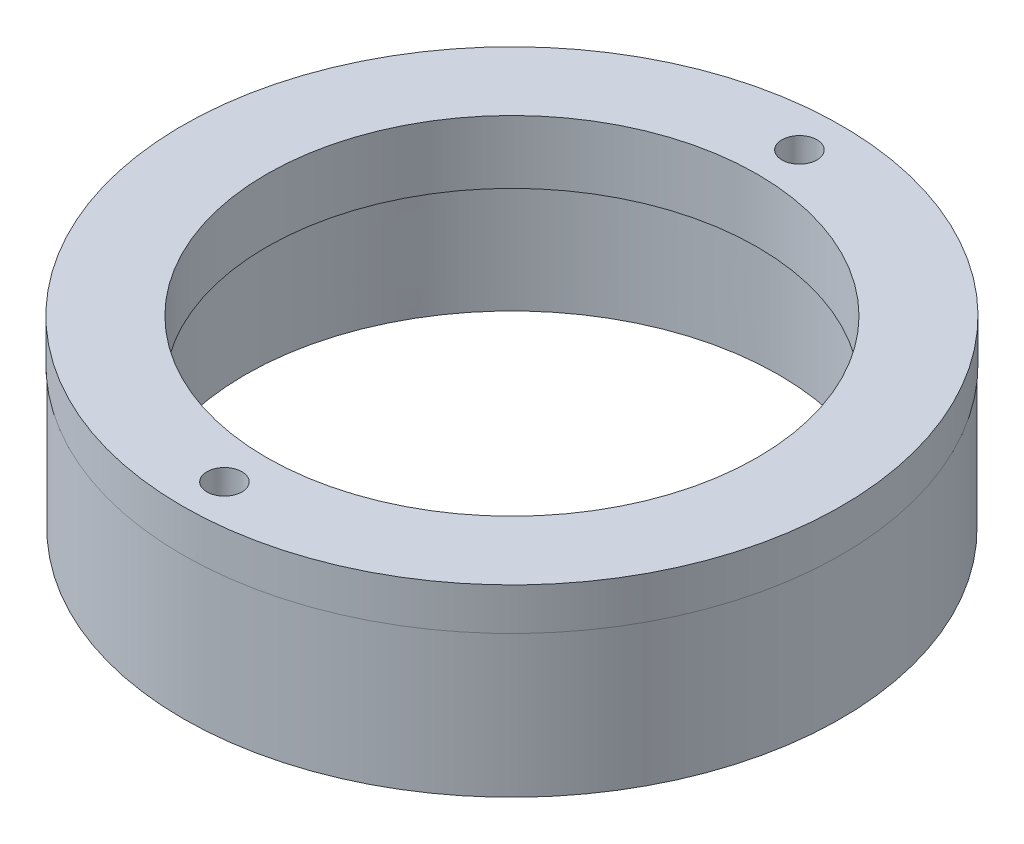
from build123d import *

# Parameters (mm, degrees)
SKETCH1_R         = 11.9126
SHAFT_DEPTH       = 6.6802
SKETCH4_R         = 11.938
CAP_DEPTH         = 1.524
SKETCH7_R         = 8.89
TOP_HOLE_DEPTH    = 2.286
SKETCH8_R         = 9.6647
BOTTOM_HOLE_DEPTH = 18.445362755
DRAFT1_ANGLE      = 0.25
SKETCH9_R         = 0.635
SIDE_HOLES_DEPTH  = 1.524


with BuildPart() as part:
    # Sketch1 → Shaft (new body)
    with BuildSketch(Plane(origin=(0, 0, 0), x_dir=(1, 0, 0), z_dir=(0, 1, 0))):
        with Locations(Location((0, 0, 0), (0, 0, 270))):
            Circle(SKETCH1_R)
    extrude(amount=-SHAFT_DEPTH)

    # Sketch4 → Cap (add)
    with BuildSketch(Plane(origin=(0, 0, 0), x_dir=(-1, 0, 0), z_dir=(0, 1, 0))):
        with Locations(Location((0, 0, 0), (0, 0, 90))):
            Circle(SKETCH4_R)
    extrude(amount=-CAP_DEPTH)

    # Sketch7 → Top Hole (cut)
    with BuildSketch(Plane(origin=(0, 0, 0), x_dir=(-1, 0, 0), z_dir=(0, 1, 0))):
        with Locations(Location((0, 0, 0), (0, 0, 90))):
            Circle(SKETCH7_R)
    extrude(amount=-TOP_HOLE_DEPTH, mode=Mode.SUBTRACT)

    # Sketch8 → Bottom Hole (cut, through all)
    with BuildSketch(Plane(origin=(0, -2.286, 0), x_dir=(-1, 0, 0), z_dir=(0, 1, 0))):
        with Locations(Location((0, 0, 0), (0, 0, 90))):
            Circle(SKETCH8_R)
    extrude(amount=-BOTTOM_HOLE_DEPTH, mode=Mode.SUBTRACT)

    # Draft1
    draft1_faces = [part.faces().sort_by_distance(p)[0] for p in [
        (0, -4.4831, -9.6647),
    ]]
    draft(draft1_faces, Plane(origin=(0, -6.6802, 0), x_dir=(0, 0, -1), z_dir=(0, -1, 0)), DRAFT1_ANGLE)

    # Sketch9 → Side Holes (cut)
    with BuildSketch(Plane(origin=(0, 0, 0), x_dir=(-1, 0, 0), z_dir=(0, 1, 0))):
        with Locations(Location((0, -10.414, 0), (0, 0, 90))):
            Circle(SKETCH9_R)
        with Locations(Location((0, 10.414, 0), (0, 0, 270))):
            Circle(SKETCH9_R)
    extrude(amount=-SIDE_HOLES_DEPTH, mode=Mode.SUBTRACT)


solid = part.part
